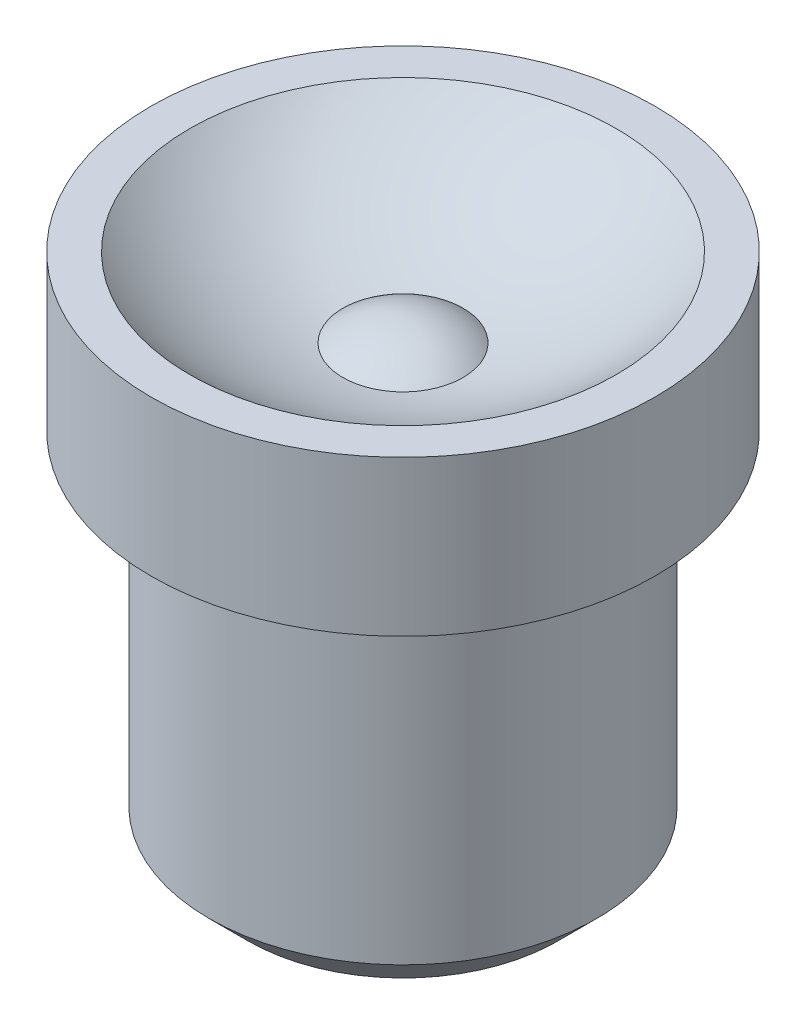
ISO-10303-21;
HEADER;
FILE_DESCRIPTION(('STEP AP214'),'2;1');
FILE_NAME('part.step','',(''),(''),'','','');
FILE_SCHEMA(('AUTOMOTIVE_DESIGN { 1 0 10303 214 1 1 1 1 }'));
ENDSEC;
DATA;
#1=APPLICATION_CONTEXT('core data for automotive mechanical design processes');
#2=APPLICATION_PROTOCOL_DEFINITION('international standard','automotive_design',2000,#1);
#3=PRODUCT_CONTEXT('',#1,'mechanical');
#4=PRODUCT('Part','Part','',(#3));
#5=PRODUCT_RELATED_PRODUCT_CATEGORY('part','',(#4));
#6=PRODUCT_DEFINITION_FORMATION('','',#4);
#7=PRODUCT_DEFINITION_CONTEXT('part definition',#1,'design');
#8=PRODUCT_DEFINITION('design','',#6,#7);
#9=PRODUCT_DEFINITION_SHAPE('','',#8);
#10=(LENGTH_UNIT() NAMED_UNIT(*) SI_UNIT(.MILLI.,.METRE.));
#11=(NAMED_UNIT(*) PLANE_ANGLE_UNIT() SI_UNIT($,.RADIAN.));
#12=(NAMED_UNIT(*) SI_UNIT($,.STERADIAN.) SOLID_ANGLE_UNIT());
#13=UNCERTAINTY_MEASURE_WITH_UNIT(LENGTH_MEASURE(1.E-05),#10,'distance_accuracy_value','');
#14=(GEOMETRIC_REPRESENTATION_CONTEXT(3) GLOBAL_UNCERTAINTY_ASSIGNED_CONTEXT((#13)) GLOBAL_UNIT_ASSIGNED_CONTEXT((#10,
#11,#12)) REPRESENTATION_CONTEXT('',''));
#15=CARTESIAN_POINT('',(0.,0.,0.));
#16=DIRECTION('',(0.,0.,1.));
#17=DIRECTION('',(1.,0.,0.));
#18=AXIS2_PLACEMENT_3D('',#15,#16,#17);
#19=CARTESIAN_POINT('',(0.,0.,0.));
#20=DIRECTION('',(0.,1.,0.));
#21=DIRECTION('',(0.,0.,1.));
#22=AXIS2_PLACEMENT_3D('',#19,#20,#21);
#23=CYLINDRICAL_SURFACE('',#22,3.25);
#24=CARTESIAN_POINT('',(0.,0.,0.));
#25=DIRECTION('',(0.,1.,0.));
#26=DIRECTION('',(0.,0.,1.));
#27=AXIS2_PLACEMENT_3D('',#24,#25,#26);
#28=CIRCLE('',#27,3.25);
#29=CARTESIAN_POINT('',(0.,0.,3.25));
#30=VERTEX_POINT('',#29);
#31=EDGE_CURVE('E43',#30,#30,#28,.T.);
#32=ORIENTED_EDGE('',*,*,#31,.F.);
#33=EDGE_LOOP('',(#32));
#34=FACE_BOUND('',#33,.T.);
#35=CARTESIAN_POINT('',(0.,-2.,0.));
#36=DIRECTION('',(0.,1.,0.));
#37=DIRECTION('',(0.,0.,1.));
#38=AXIS2_PLACEMENT_3D('',#35,#36,#37);
#39=CIRCLE('',#38,3.25);
#40=CARTESIAN_POINT('',(0.,-2.,3.25));
#41=VERTEX_POINT('',#40);
#42=EDGE_CURVE('E64',#41,#41,#39,.T.);
#43=ORIENTED_EDGE('',*,*,#42,.T.);
#44=EDGE_LOOP('',(#43));
#45=FACE_BOUND('',#44,.T.);
#46=ADVANCED_FACE('F32',(#34,#45),#23,.T.);
#47=CARTESIAN_POINT('',(2.75,0.,0.));
#48=DIRECTION('',(0.,-1.,0.));
#49=DIRECTION('',(0.,0.,-1.));
#50=AXIS2_PLACEMENT_3D('',#47,#48,#49);
#51=PLANE('',#50);
#52=CARTESIAN_POINT('',(0.,0.,0.));
#53=DIRECTION('',(0.,1.,0.));
#54=DIRECTION('',(0.,0.,1.));
#55=AXIS2_PLACEMENT_3D('',#52,#53,#54);
#56=CIRCLE('',#55,2.75);
#57=CARTESIAN_POINT('',(2.75,0.,0.));
#58=VERTEX_POINT('',#57);
#59=EDGE_CURVE('E47',#58,#58,#56,.T.);
#60=ORIENTED_EDGE('',*,*,#59,.F.);
#61=EDGE_LOOP('',(#60));
#62=FACE_BOUND('',#61,.T.);
#63=ORIENTED_EDGE('',*,*,#31,.T.);
#64=EDGE_LOOP('',(#63));
#65=FACE_BOUND('',#64,.T.);
#66=ADVANCED_FACE('F85',(#62,#65),#51,.F.);
#67=CARTESIAN_POINT('',(0.,2.90473750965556,0.));
#68=DIRECTION('',(0.,1.,0.));
#69=DIRECTION('',(1.,0.,0.));
#70=AXIS2_PLACEMENT_3D('',#67,#68,#69);
#71=SPHERICAL_SURFACE('',#70,4.);
#72=CARTESIAN_POINT('',(0.,-1.01942254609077,0.));
#73=DIRECTION('',(0.,1.,0.));
#74=DIRECTION('',(0.,0.,1.));
#75=AXIS2_PLACEMENT_3D('',#72,#73,#74);
#76=CIRCLE('',#75,0.775221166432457);
#77=CARTESIAN_POINT('',(0.775221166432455,-1.01942254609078,0.));
#78=VERTEX_POINT('',#77);
#79=EDGE_CURVE('E52',#78,#78,#76,.T.);
#80=CARTESIAN_POINT('',(0.775221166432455,-1.01942254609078,0.));
#81=CARTESIAN_POINT('',(0.7982347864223,-1.01487620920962,0.));
#82=CARTESIAN_POINT('',(0.821208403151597,-1.01012737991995,0.));
#83=CARTESIAN_POINT('',(0.867068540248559,-1.00022630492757,0.));
#84=CARTESIAN_POINT('',(0.889955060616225,-0.995074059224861,0.));
#85=CARTESIAN_POINT('',(0.935633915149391,-0.984367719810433,0.));
#86=CARTESIAN_POINT('',(0.958426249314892,-0.978813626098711,0.));
#87=CARTESIAN_POINT('',(1.00390967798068,-0.967305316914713,0.));
#88=CARTESIAN_POINT('',(1.02660077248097,-0.961351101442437,0.));
#89=CARTESIAN_POINT('',(1.07187469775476,-0.949044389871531,0.));
#90=CARTESIAN_POINT('',(1.09445752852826,-0.942691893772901,0.));
#91=CARTESIAN_POINT('',(1.13950793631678,-0.929590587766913,0.));
#92=CARTESIAN_POINT('',(1.16197551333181,-0.922841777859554,0.));
#93=CARTESIAN_POINT('',(1.20678845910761,-0.908949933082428,0.));
#94=CARTESIAN_POINT('',(1.22913382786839,-0.901806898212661,0.));
#95=CARTESIAN_POINT('',(1.27369544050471,-0.887128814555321,0.));
#96=CARTESIAN_POINT('',(1.29591168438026,-0.879593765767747,0.));
#97=CARTESIAN_POINT('',(1.34020817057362,-0.864133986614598,0.));
#98=CARTESIAN_POINT('',(1.36228841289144,-0.856209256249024,0.));
#99=CARTESIAN_POINT('',(1.40630606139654,-0.839972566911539,0.));
#100=CARTESIAN_POINT('',(1.42824346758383,-0.83166060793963,0.));
#101=CARTESIAN_POINT('',(1.47196865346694,-0.814652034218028,0.));
#102=CARTESIAN_POINT('',(1.49375643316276,-0.805955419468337,0.));
#103=CARTESIAN_POINT('',(1.53717562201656,-0.788180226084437,0.));
#104=CARTESIAN_POINT('',(1.55880703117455,-0.779101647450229,0.));
#105=CARTESIAN_POINT('',(1.60190678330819,-0.760565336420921,0.));
#106=CARTESIAN_POINT('',(1.62337512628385,-0.751107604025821,0.));
#107=CARTESIAN_POINT('',(1.66614210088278,-0.731815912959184,0.));
#108=CARTESIAN_POINT('',(1.68744073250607,-0.721981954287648,0.));
#109=CARTESIAN_POINT('',(1.72986169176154,-0.701940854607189,0.));
#110=CARTESIAN_POINT('',(1.75098401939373,-0.691733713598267,0.));
#111=CARTESIAN_POINT('',(1.7930458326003,-0.670949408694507,0.));
#112=CARTESIAN_POINT('',(1.81398531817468,-0.660372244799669,0.));
#113=CARTESIAN_POINT('',(1.85567496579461,-0.638851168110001,0.));
#114=CARTESIAN_POINT('',(1.87642512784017,-0.627907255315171,0.));
#115=CARTESIAN_POINT('',(1.91772970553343,-0.605656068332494,0.));
#116=CARTESIAN_POINT('',(1.93828412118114,-0.594348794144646,0.));
#117=CARTESIAN_POINT('',(1.97919084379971,-0.571374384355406,0.));
#118=CARTESIAN_POINT('',(1.99954315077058,-0.559707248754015,0.));
#119=CARTESIAN_POINT('',(2.0400393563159,-0.536016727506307,0.));
#120=CARTESIAN_POINT('',(2.06018325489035,-0.523993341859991,0.));
#121=CARTESIAN_POINT('',(2.1002564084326,-0.499594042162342,0.));
#122=CARTESIAN_POINT('',(2.1201856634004,-0.487218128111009,0.));
#123=CARTESIAN_POINT('',(2.15982336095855,-0.462117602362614,0.));
#124=CARTESIAN_POINT('',(2.1795318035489,-0.449392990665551,0.));
#125=CARTESIAN_POINT('',(2.21872177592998,-0.423599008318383,0.));
#126=CARTESIAN_POINT('',(2.23820330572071,-0.410529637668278,0.));
#127=CARTESIAN_POINT('',(2.2769334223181,-0.384050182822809,0.));
#128=CARTESIAN_POINT('',(2.29618200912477,-0.370640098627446,0.));
#129=CARTESIAN_POINT('',(2.33444028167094,-0.343483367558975,0.));
#130=CARTESIAN_POINT('',(2.35344996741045,-0.329736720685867,0.));
#131=CARTESIAN_POINT('',(2.39122455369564,-0.301911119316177,0.));
#132=CARTESIAN_POINT('',(2.40998945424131,-0.287832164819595,0.));
#133=CARTESIAN_POINT('',(2.44726866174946,-0.259346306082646,0.));
#134=CARTESIAN_POINT('',(2.46578296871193,-0.244939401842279,0.));
#135=CARTESIAN_POINT('',(2.50255525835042,-0.215802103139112,0.));
#136=CARTESIAN_POINT('',(2.52081324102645,-0.201071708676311,0.));
#137=CARTESIAN_POINT('',(2.5570672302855,-0.171291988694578,0.));
#138=CARTESIAN_POINT('',(2.57506323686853,-0.156242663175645,0.));
#139=CARTESIAN_POINT('',(2.61078770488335,-0.125829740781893,0.));
#140=CARTESIAN_POINT('',(2.62851616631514,-0.110466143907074,0.));
#141=CARTESIAN_POINT('',(2.66370005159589,-0.0794294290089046,0.));
#142=CARTESIAN_POINT('',(2.68115547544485,-0.0637563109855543,0.));
#143=CARTESIAN_POINT('',(2.71578790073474,-0.032105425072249,0.));
#144=CARTESIAN_POINT('',(2.73296490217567,-0.016127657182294,0.));
#145=CARTESIAN_POINT('',(2.75,0.,0.));
#146=B_SPLINE_CURVE_WITH_KNOTS('',3,(#80,#81,#82,#83,#84,#85,#86,#87,#88,#89,#90,#91,#92,#93,
#94,#95,#96,#97,#98,#99,#100,#101,#102,#103,#104,#105,#106,#107,#108,#109,#110,#111,#112,#113,
#114,#115,#116,#117,#118,#119,#120,#121,#122,#123,#124,#125,#126,#127,#128,#129,#130,#131,#132,
#133,#134,#135,#136,#137,#138,#139,#140,#141,#142,#143,#144,#145),.UNSPECIFIED.,.F.,.F.,(4,2,2,
2,2,2,2,2,2,2,2,2,2,2,2,2,2,2,2,2,2,2,2,2,2,2,2,2,2,2,2,2,4),(0.,0.0703742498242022,
0.140748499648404,0.211122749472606,0.281496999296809,0.351871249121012,0.422245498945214,
0.492619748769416,0.562993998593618,0.63336824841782,0.703742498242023,0.774116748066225,
0.844490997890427,0.914865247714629,0.985239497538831,1.05561374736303,1.12598799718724,
1.19636224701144,1.26673649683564,1.33711074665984,1.40748499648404,1.47785924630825,
1.54823349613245,1.61860774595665,1.68898199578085,1.75935624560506,1.82973049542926,
1.90010474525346,1.97047899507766,2.04085324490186,2.11122749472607,2.18160174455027,
2.25197599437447),.UNSPECIFIED.);
#147=EDGE_CURVE('BSEAM90',#78,#58,#146,.T.);
#148=ORIENTED_EDGE('',*,*,#79,.F.);
#149=ORIENTED_EDGE('',*,*,#59,.T.);
#150=ORIENTED_EDGE('',*,*,#147,.T.);
#151=ORIENTED_EDGE('',*,*,#147,.F.);
#152=EDGE_LOOP('',(#148,#150,#149,#151));
#153=FACE_BOUND('',#152,.T.);
#154=ADVANCED_FACE('F90',(#153),#71,.F.);
#155=CARTESIAN_POINT('',(0.,-2.,0.));
#156=DIRECTION('',(0.,1.,0.));
#157=DIRECTION('',(1.,0.,0.));
#158=AXIS2_PLACEMENT_3D('',#155,#156,#157);
#159=SPHERICAL_SURFACE('',#158,1.25);
#160=ORIENTED_EDGE('',*,*,#79,.T.);
#161=EDGE_LOOP('',(#160));
#162=FACE_BOUND('',#161,.T.);
#163=ADVANCED_FACE('F97',(#162),#159,.T.);
#164=CARTESIAN_POINT('',(0.,-2.,0.));
#165=DIRECTION('',(0.,1.,0.));
#166=DIRECTION('',(1.,0.,0.));
#167=AXIS2_PLACEMENT_3D('',#164,#165,#166);
#168=SPHERICAL_SURFACE('',#167,1.25);
#169=CARTESIAN_POINT('',(0.,-2.96046863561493,0.));
#170=DIRECTION('',(0.,1.,0.));
#171=DIRECTION('',(0.,0.,1.));
#172=AXIS2_PLACEMENT_3D('',#169,#170,#171);
#173=CIRCLE('',#172,0.800000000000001);
#174=CARTESIAN_POINT('',(0.,-2.96046863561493,0.800000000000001));
#175=VERTEX_POINT('',#174);
#176=EDGE_CURVE('E55',#175,#175,#173,.T.);
#177=ORIENTED_EDGE('',*,*,#176,.F.);
#178=EDGE_LOOP('',(#177));
#179=FACE_BOUND('',#178,.T.);
#180=ADVANCED_FACE('F101',(#179),#168,.T.);
#181=CARTESIAN_POINT('',(0.,0.,0.));
#182=DIRECTION('',(0.,1.,0.));
#183=DIRECTION('',(0.,0.,1.));
#184=AXIS2_PLACEMENT_3D('',#181,#182,#183);
#185=CYLINDRICAL_SURFACE('',#184,0.800000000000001);
#186=CARTESIAN_POINT('',(0.,-6.7,0.));
#187=DIRECTION('',(0.,1.,0.));
#188=DIRECTION('',(0.,0.,1.));
#189=AXIS2_PLACEMENT_3D('',#186,#187,#188);
#190=CIRCLE('',#189,0.800000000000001);
#191=CARTESIAN_POINT('',(0.,-6.7,0.800000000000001));
#192=VERTEX_POINT('',#191);
#193=EDGE_CURVE('E58',#192,#192,#190,.T.);
#194=ORIENTED_EDGE('',*,*,#193,.F.);
#195=EDGE_LOOP('',(#194));
#196=FACE_BOUND('',#195,.T.);
#197=ORIENTED_EDGE('',*,*,#176,.T.);
#198=EDGE_LOOP('',(#197));
#199=FACE_BOUND('',#198,.T.);
#200=ADVANCED_FACE('F82',(#196,#199),#185,.F.);
#201=CARTESIAN_POINT('',(2.5,-6.7,0.));
#202=DIRECTION('',(0.,1.,0.));
#203=DIRECTION('',(0.,0.,1.));
#204=AXIS2_PLACEMENT_3D('',#201,#202,#203);
#205=PLANE('',#204);
#206=CARTESIAN_POINT('',(0.,-6.7,0.));
#207=DIRECTION('',(0.,1.,0.));
#208=DIRECTION('',(0.,0.,1.));
#209=AXIS2_PLACEMENT_3D('',#206,#207,#208);
#210=CIRCLE('',#209,2.);
#211=CARTESIAN_POINT('',(0.,-6.7,2.));
#212=VERTEX_POINT('',#211);
#213=EDGE_CURVE('E10',#212,#212,#210,.F.);
#214=ORIENTED_EDGE('',*,*,#213,.T.);
#215=EDGE_LOOP('',(#214));
#216=FACE_BOUND('',#215,.T.);
#217=ORIENTED_EDGE('',*,*,#193,.T.);
#218=EDGE_LOOP('',(#217));
#219=FACE_BOUND('',#218,.T.);
#220=ADVANCED_FACE('F77',(#216,#219),#205,.F.);
#221=CARTESIAN_POINT('',(0.,0.,0.));
#222=DIRECTION('',(0.,1.,0.));
#223=DIRECTION('',(0.,0.,1.));
#224=AXIS2_PLACEMENT_3D('',#221,#222,#223);
#225=CYLINDRICAL_SURFACE('',#224,2.5);
#226=CARTESIAN_POINT('',(0.,-6.2,0.));
#227=DIRECTION('',(0.,1.,0.));
#228=DIRECTION('',(0.,0.,1.));
#229=AXIS2_PLACEMENT_3D('',#226,#227,#228);
#230=CIRCLE('',#229,2.5);
#231=CARTESIAN_POINT('',(0.,-6.2,2.5));
#232=VERTEX_POINT('',#231);
#233=EDGE_CURVE('E39',#232,#232,#230,.T.);
#234=ORIENTED_EDGE('',*,*,#233,.T.);
#235=EDGE_LOOP('',(#234));
#236=FACE_BOUND('',#235,.T.);
#237=CARTESIAN_POINT('',(0.,-2.,0.));
#238=DIRECTION('',(0.,1.,0.));
#239=DIRECTION('',(0.,0.,1.));
#240=AXIS2_PLACEMENT_3D('',#237,#238,#239);
#241=CIRCLE('',#240,2.5);
#242=CARTESIAN_POINT('',(0.,-2.,2.5));
#243=VERTEX_POINT('',#242);
#244=EDGE_CURVE('E61',#243,#243,#241,.T.);
#245=ORIENTED_EDGE('',*,*,#244,.F.);
#246=EDGE_LOOP('',(#245));
#247=FACE_BOUND('',#246,.T.);
#248=ADVANCED_FACE('F72',(#236,#247),#225,.T.);
#249=CARTESIAN_POINT('',(3.25,-2.,0.));
#250=DIRECTION('',(0.,1.,0.));
#251=DIRECTION('',(0.,0.,1.));
#252=AXIS2_PLACEMENT_3D('',#249,#250,#251);
#253=PLANE('',#252);
#254=ORIENTED_EDGE('',*,*,#42,.F.);
#255=EDGE_LOOP('',(#254));
#256=FACE_BOUND('',#255,.T.);
#257=ORIENTED_EDGE('',*,*,#244,.T.);
#258=EDGE_LOOP('',(#257));
#259=FACE_BOUND('',#258,.T.);
#260=ADVANCED_FACE('F69',(#256,#259),#253,.F.);
#261=CARTESIAN_POINT('',(0.,-6.2,0.));
#262=DIRECTION('',(0.,1.,0.));
#263=DIRECTION('',(0.,0.,1.));
#264=AXIS2_PLACEMENT_3D('',#261,#262,#263);
#265=CONICAL_SURFACE('',#264,2.5,0.78539816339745);
#266=ORIENTED_EDGE('',*,*,#213,.F.);
#267=EDGE_LOOP('',(#266));
#268=FACE_BOUND('',#267,.T.);
#269=ORIENTED_EDGE('',*,*,#233,.F.);
#270=EDGE_LOOP('',(#269));
#271=FACE_BOUND('',#270,.T.);
#272=ADVANCED_FACE('F34',(#268,#271),#265,.T.);
#273=CLOSED_SHELL('',(#46,#66,#154,#163,#180,#200,#220,#248,#260,#272));
#274=MANIFOLD_SOLID_BREP('B2',#273);
#275=ADVANCED_BREP_SHAPE_REPRESENTATION('',(#18,#274),#14);
#276=SHAPE_DEFINITION_REPRESENTATION(#9,#275);
ENDSEC;
END-ISO-10303-21;
